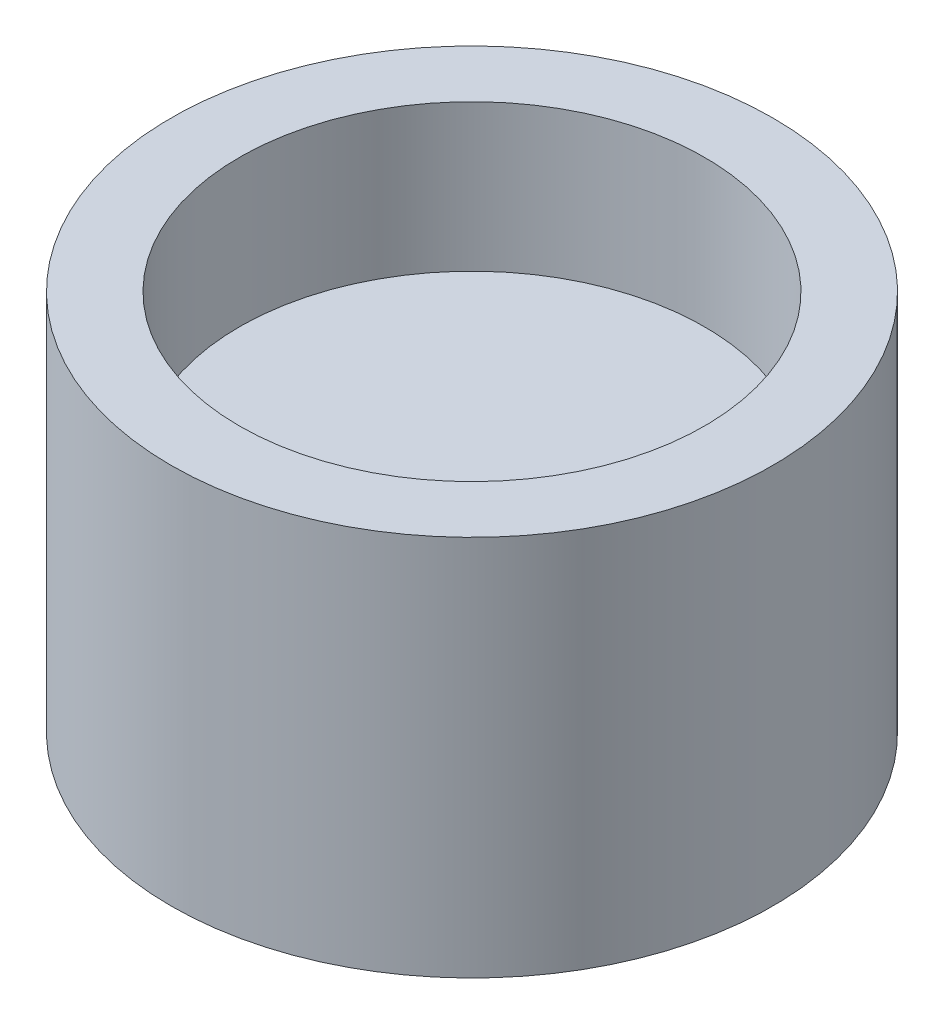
from build123d import *

# Parameters (mm, degrees)
SKETCH1_R           = 5.207
BOSS_EXTRUDE1_DEPTH = 6.604
SKETCH2_R           = 4.0259
CUT_EXTRUDE1_DEPTH  = 2.54
SKETCH3_R           = 4.7625
CUT_EXTRUDE2_DEPTH  = 3.175


with BuildPart() as part:
    # Sketch1 → Boss-Extrude1 (new body)
    with BuildSketch(Plane(origin=(0, 0, 0), x_dir=(1, 0, 0), z_dir=(0, 1, 0))):
        with Locations(Location((0, 0, 0), (0, 0, 90))):
            Circle(SKETCH1_R)
    extrude(amount=BOSS_EXTRUDE1_DEPTH)

    # Sketch2 → Cut-Extrude1 (cut)
    with BuildSketch(Plane(origin=(0, 6.604, 0), x_dir=(1, 0, 0), z_dir=(0, 1, 0))):
        with Locations(Location((0, 0, 0), (0, 0, 270))):
            Circle(SKETCH2_R)
    extrude(amount=-CUT_EXTRUDE1_DEPTH, mode=Mode.SUBTRACT)

    # Sketch3 → Cut-Extrude2 (cut)
    with BuildSketch(Plane.XZ):
        with Locations(Location((0, 0, 0), (0, 0, 270))):
            Circle(SKETCH3_R)
    extrude(amount=-CUT_EXTRUDE2_DEPTH, mode=Mode.SUBTRACT)


solid = part.part
